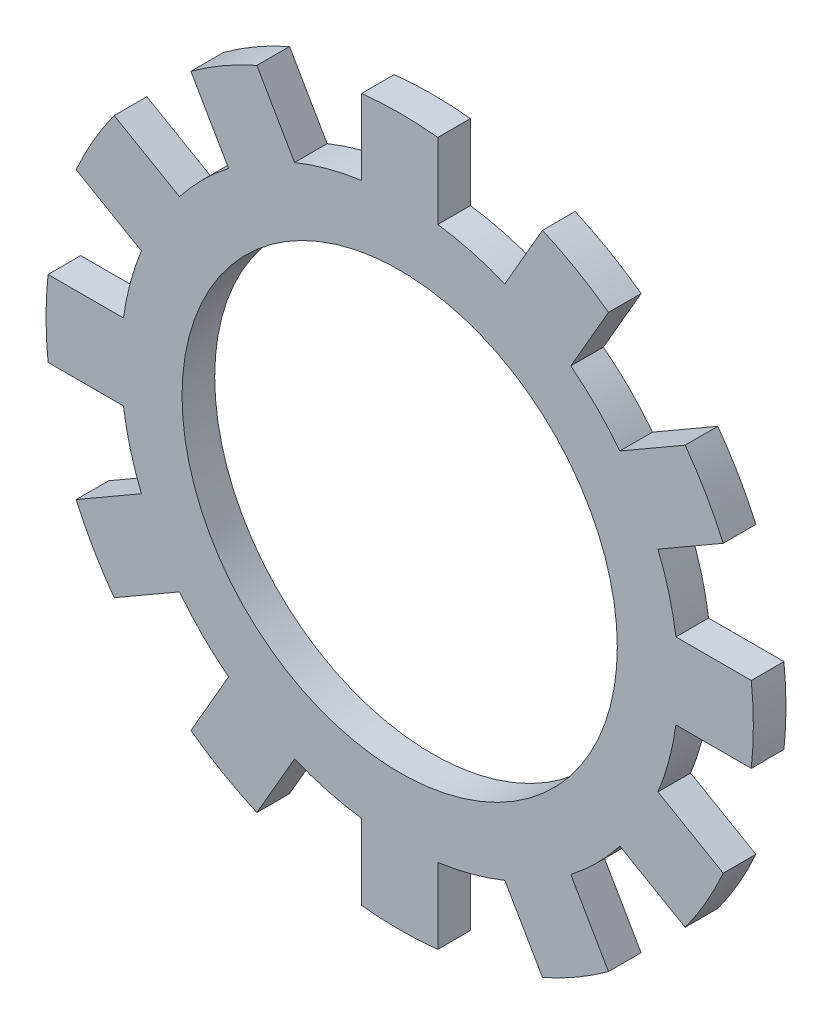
from build123d import *

# Parameters (mm, degrees)
SKETCH1_R                 = 10.25
SKETCH1_R_2               = 8
BOSS_EXTRUDE1_DEPTH       = 0.6
BOSS_EXTRUDE2_DEPTH       = 0.6
CIRPATTERN2_COUNT         = 12
CIRPATTERN2_COPY_1_DEPTH  = 0.6
CIRPATTERN2_COPY_2_DEPTH  = 0.6
CIRPATTERN2_COPY_3_DEPTH  = 0.6
CIRPATTERN2_COPY_4_DEPTH  = 0.6
CIRPATTERN2_COPY_5_DEPTH  = 0.6
CIRPATTERN2_COPY_6_DEPTH  = 0.6
CIRPATTERN2_COPY_7_DEPTH  = 0.6
CIRPATTERN2_COPY_8_DEPTH  = 0.6
CIRPATTERN2_COPY_9_DEPTH  = 0.6
CIRPATTERN2_COPY_10_DEPTH = 0.6
CIRPATTERN2_COPY_11_DEPTH = 0.6


with BuildPart() as part:
    # Sketch1 → Boss-Extrude1 (new, symmetric)
    with BuildSketch(Plane.XY):
        Circle(SKETCH1_R)
        Circle(SKETCH1_R_2, mode=Mode.SUBTRACT)
    extrude(amount=BOSS_EXTRUDE1_DEPTH, both=True)

    # Sketch3 → Boss-Extrude2 (add, symmetric)
    with BuildSketch(Plane.XY):
        with BuildLine():
            Line((-1.4, 12.924395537), (-1.4, 10.153940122))
            ThreePointArc((-1.4, 10.153940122), (-0.701645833, 10.225956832), (0, 10.25))
            Line((0, 10.25), (0, 13))
            ThreePointArc((0, 13), (-0.701019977, 12.981085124), (-1.4, 12.924395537))
        make_face()
    boss_extrude2 = extrude(amount=BOSS_EXTRUDE2_DEPTH, both=True)

    # Mirror1: Boss-Extrude2 across plane
    add(boss_extrude2.mirror(Plane(origin=(0, 0, 0), x_dir=(0, 0, 1), z_dir=(1, 0, 0))))

    # CirPattern2: Boss-Extrude2 ×12 about axis
    cirpattern2_axis = Axis((0, 0, 0), (0, 0, 1))
    for i in range(1, CIRPATTERN2_COUNT):
        add(boss_extrude2.rotate(cirpattern2_axis, i * 360 / CIRPATTERN2_COUNT))

    # CirPattern2 copy 1 sketch → CirPattern2 copy 1 (add, symmetric)
    with BuildSketch(Plane(origin=(0, 0, 0), x_dir=(-0.8660254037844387, -0.49999999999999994, 0), z_dir=(0, 0, 1))):
        with BuildLine():
            Line((-1.4, -12.924395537), (-1.4, -10.153940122))
            ThreePointArc((-1.4, -10.153940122), (-0.701645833, -10.225956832), (0, -10.25))
            Line((0, -10.25), (0, -13))
            ThreePointArc((0, -13), (-0.701019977, -12.981085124), (-1.4, -12.924395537))
        make_face()
    extrude(amount=CIRPATTERN2_COPY_1_DEPTH, both=True)

    # CirPattern2 copy 2 sketch → CirPattern2 copy 2 (add, symmetric)
    with BuildSketch(Plane(origin=(0, 0, 0), x_dir=(-0.5000000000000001, -0.8660254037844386, 0), z_dir=(0, 0, 1))):
        with BuildLine():
            Line((-1.4, -12.924395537), (-1.4, -10.153940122))
            ThreePointArc((-1.4, -10.153940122), (-0.701645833, -10.225956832), (0, -10.25))
            Line((0, -10.25), (0, -13))
            ThreePointArc((0, -13), (-0.701019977, -12.981085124), (-1.4, -12.924395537))
        make_face()
    extrude(amount=CIRPATTERN2_COPY_2_DEPTH, both=True)

    # CirPattern2 copy 3 sketch → CirPattern2 copy 3 (add, symmetric)
    with BuildSketch(Plane(origin=(0, 0, 0), x_dir=(0, -1, 0), z_dir=(0, 0, 1))):
        with BuildLine():
            Line((-1.4, -12.924395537), (-1.4, -10.153940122))
            ThreePointArc((-1.4, -10.153940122), (-0.701645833, -10.225956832), (0, -10.25))
            Line((0, -10.25), (0, -13))
            ThreePointArc((0, -13), (-0.701019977, -12.981085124), (-1.4, -12.924395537))
        make_face()
    extrude(amount=CIRPATTERN2_COPY_3_DEPTH, both=True)

    # CirPattern2 copy 4 sketch → CirPattern2 copy 4 (add, symmetric)
    with BuildSketch(Plane(origin=(0, 0, 0), x_dir=(0.4999999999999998, -0.8660254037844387, 0), z_dir=(0, 0, 1))):
        with BuildLine():
            Line((-1.4, -12.924395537), (-1.4, -10.153940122))
            ThreePointArc((-1.4, -10.153940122), (-0.701645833, -10.225956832), (0, -10.25))
            Line((0, -10.25), (0, -13))
            ThreePointArc((0, -13), (-0.701019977, -12.981085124), (-1.4, -12.924395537))
        make_face()
    extrude(amount=CIRPATTERN2_COPY_4_DEPTH, both=True)

    # CirPattern2 copy 5 sketch → CirPattern2 copy 5 (add, symmetric)
    with BuildSketch(Plane(origin=(0, 0, 0), x_dir=(0.8660254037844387, -0.49999999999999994, 0), z_dir=(0, 0, 1))):
        with BuildLine():
            Line((-1.4, -12.924395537), (-1.4, -10.153940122))
            ThreePointArc((-1.4, -10.153940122), (-0.701645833, -10.225956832), (0, -10.25))
            Line((0, -10.25), (0, -13))
            ThreePointArc((0, -13), (-0.701019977, -12.981085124), (-1.4, -12.924395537))
        make_face()
    extrude(amount=CIRPATTERN2_COPY_5_DEPTH, both=True)

    # CirPattern2 copy 6 sketch → CirPattern2 copy 6 (add, symmetric)
    with BuildSketch(Plane.XY):
        with BuildLine():
            Line((-1.4, -12.924395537), (-1.4, -10.153940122))
            ThreePointArc((-1.4, -10.153940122), (-0.701645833, -10.225956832), (0, -10.25))
            Line((0, -10.25), (0, -13))
            ThreePointArc((0, -13), (-0.701019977, -12.981085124), (-1.4, -12.924395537))
        make_face()
    extrude(amount=CIRPATTERN2_COPY_6_DEPTH, both=True)

    # CirPattern2 copy 7 sketch → CirPattern2 copy 7 (add, symmetric)
    with BuildSketch(Plane(origin=(0, 0, 0), x_dir=(0.8660254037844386, 0.5000000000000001, 0), z_dir=(0, 0, 1))):
        with BuildLine():
            Line((-1.4, -12.924395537), (-1.4, -10.153940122))
            ThreePointArc((-1.4, -10.153940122), (-0.701645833, -10.225956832), (0, -10.25))
            Line((0, -10.25), (0, -13))
            ThreePointArc((0, -13), (-0.701019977, -12.981085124), (-1.4, -12.924395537))
        make_face()
    extrude(amount=CIRPATTERN2_COPY_7_DEPTH, both=True)

    # CirPattern2 copy 8 sketch → CirPattern2 copy 8 (add, symmetric)
    with BuildSketch(Plane(origin=(0, 0, 0), x_dir=(0.5000000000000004, 0.8660254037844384, 0), z_dir=(0, 0, 1))):
        with BuildLine():
            Line((-1.4, -12.924395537), (-1.4, -10.153940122))
            ThreePointArc((-1.4, -10.153940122), (-0.701645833, -10.225956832), (0, -10.25))
            Line((0, -10.25), (0, -13))
            ThreePointArc((0, -13), (-0.701019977, -12.981085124), (-1.4, -12.924395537))
        make_face()
    extrude(amount=CIRPATTERN2_COPY_8_DEPTH, both=True)

    # CirPattern2 copy 9 sketch → CirPattern2 copy 9 (add, symmetric)
    with BuildSketch(Plane(origin=(0, 0, 0), x_dir=(0, 1, 0), z_dir=(0, 0, 1))):
        with BuildLine():
            Line((-1.4, -12.924395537), (-1.4, -10.153940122))
            ThreePointArc((-1.4, -10.153940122), (-0.701645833, -10.225956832), (0, -10.25))
            Line((0, -10.25), (0, -13))
            ThreePointArc((0, -13), (-0.701019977, -12.981085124), (-1.4, -12.924395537))
        make_face()
    extrude(amount=CIRPATTERN2_COPY_9_DEPTH, both=True)

    # CirPattern2 copy 10 sketch → CirPattern2 copy 10 (add, symmetric)
    with BuildSketch(Plane(origin=(0, 0, 0), x_dir=(-0.5000000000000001, 0.8660254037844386, 0), z_dir=(0, 0, 1))):
        with BuildLine():
            Line((-1.4, -12.924395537), (-1.4, -10.153940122))
            ThreePointArc((-1.4, -10.153940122), (-0.701645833, -10.225956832), (0, -10.25))
            Line((0, -10.25), (0, -13))
            ThreePointArc((0, -13), (-0.701019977, -12.981085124), (-1.4, -12.924395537))
        make_face()
    extrude(amount=CIRPATTERN2_COPY_10_DEPTH, both=True)

    # CirPattern2 copy 11 sketch → CirPattern2 copy 11 (add, symmetric)
    with BuildSketch(Plane(origin=(0, 0, 0), x_dir=(-0.8660254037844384, 0.5000000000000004, 0), z_dir=(0, 0, 1))):
        with BuildLine():
            Line((-1.4, -12.924395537), (-1.4, -10.153940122))
            ThreePointArc((-1.4, -10.153940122), (-0.701645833, -10.225956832), (0, -10.25))
            Line((0, -10.25), (0, -13))
            ThreePointArc((0, -13), (-0.701019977, -12.981085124), (-1.4, -12.924395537))
        make_face()
    extrude(amount=CIRPATTERN2_COPY_11_DEPTH, both=True)


solid = part.part
